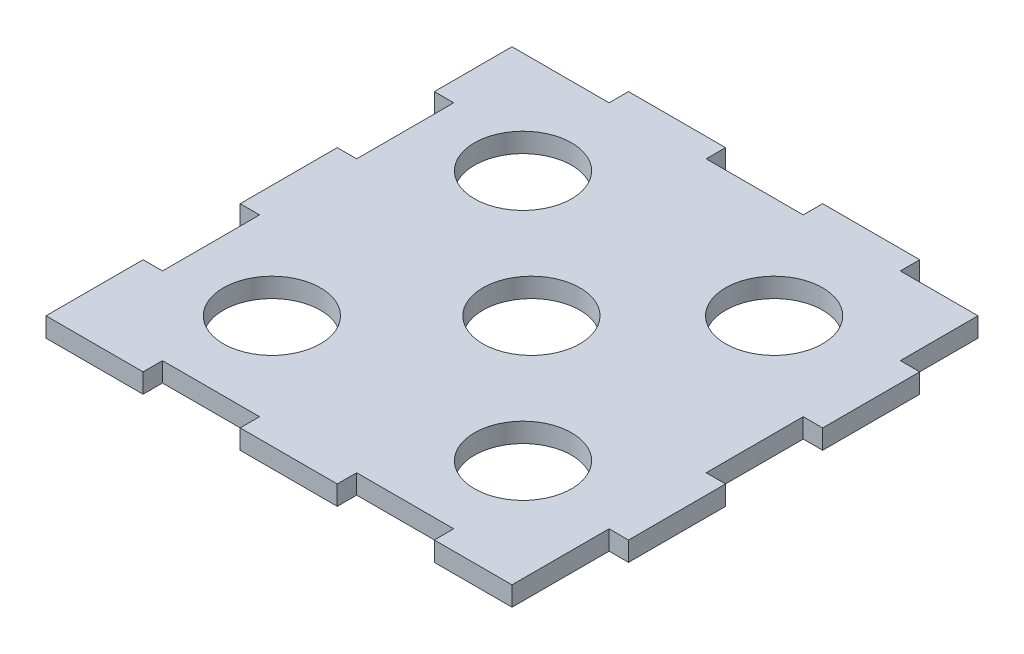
from build123d import *

# Parameters (mm, degrees)
SKETCH2_R           = 10
BOSS_EXTRUDE1_DEPTH = 4


with BuildPart() as part:
    # Sketch2 → Boss-Extrude1 (new body)
    with BuildSketch(Plane(origin=(0, 0, 0), x_dir=(1, 0, 0), z_dir=(0, 1, 0))):
        Polygon((-50, 46), (-30, 46), (-30, 50), (-10, 50), (-10, 46), (10, 46), (10, 50), (30, 50), (30, 46), (46, 46), (46, 30), (50, 30), (50, 10), (46, 10), (46, -10), (50, -10), (50, -30), (46, -30), (46, -50), (30, -50), (30, -46), (10, -46), (10, -50), (-10, -50), (-10, -46), (-30, -46), (-30, -50), (-50, -50), (-50, -30), (-46, -30), (-46, -10), (-50, -10), (-50, 10), (-46, 10), (-46, 30), (-50, 30), align=None)
        with Locations(Location((0, 0, 0), (0, 0, 270))):
            Circle(SKETCH2_R, mode=Mode.SUBTRACT)
        with Locations(Location((25, 25, 0), (0, 0, 270))):
            Circle(SKETCH2_R, mode=Mode.SUBTRACT)
        with Locations(Location((25, -26.732086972, 0), (0, 0, 270))):
            Circle(SKETCH2_R, mode=Mode.SUBTRACT)
        with Locations(Location((-26.732086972, -26.732086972, 0), (0, 0, 270))):
            Circle(SKETCH2_R, mode=Mode.SUBTRACT)
        with Locations(Location((-26.732086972, 25, 0), (0, 0, 270))):
            Circle(SKETCH2_R, mode=Mode.SUBTRACT)
    extrude(amount=BOSS_EXTRUDE1_DEPTH)


solid = part.part
